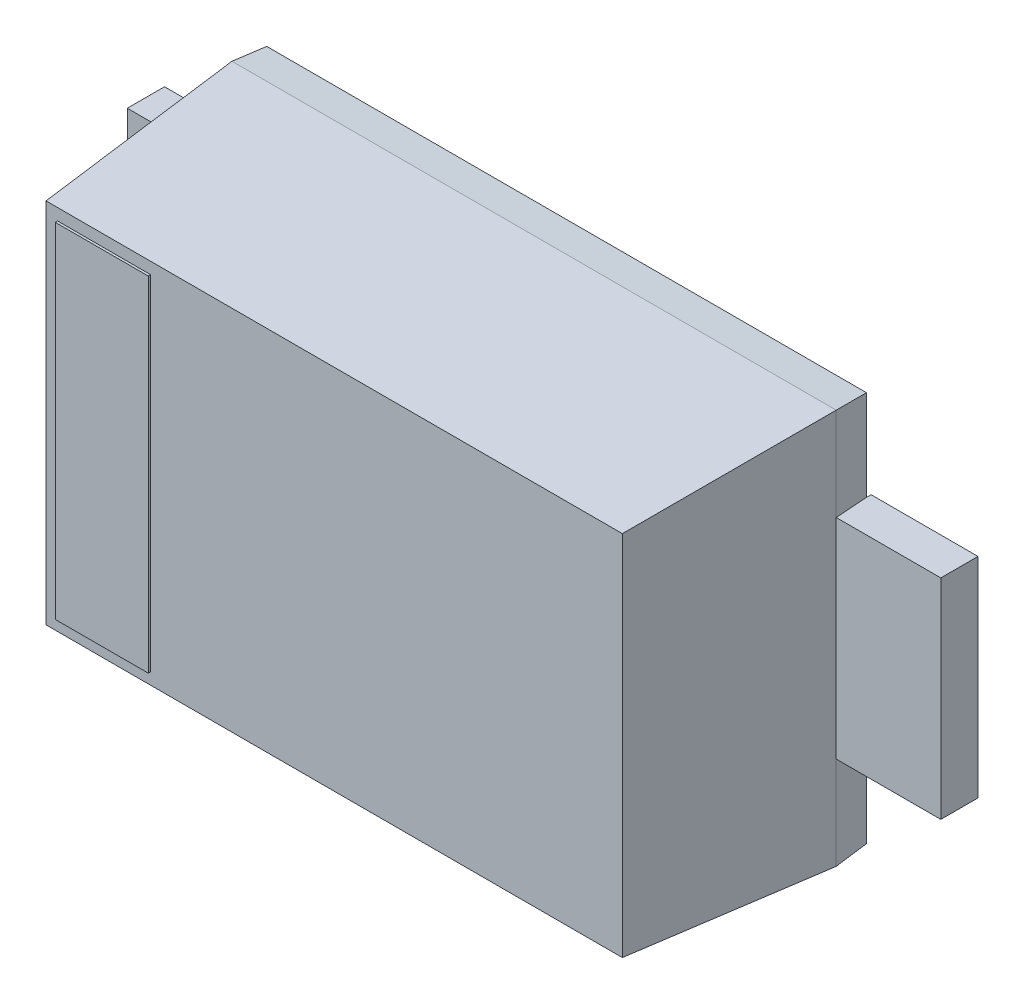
ISO-10303-21;
HEADER;
FILE_DESCRIPTION(('STEP AP214'),'2;1');
FILE_NAME('part.step','',(''),(''),'','','');
FILE_SCHEMA(('AUTOMOTIVE_DESIGN { 1 0 10303 214 1 1 1 1 }'));
ENDSEC;
DATA;
#1=APPLICATION_CONTEXT('core data for automotive mechanical design processes');
#2=APPLICATION_PROTOCOL_DEFINITION('international standard','automotive_design',2000,#1);
#3=PRODUCT_CONTEXT('',#1,'mechanical');
#4=PRODUCT('Part','Part','',(#3));
#5=PRODUCT_RELATED_PRODUCT_CATEGORY('part','',(#4));
#6=PRODUCT_DEFINITION_FORMATION('','',#4);
#7=PRODUCT_DEFINITION_CONTEXT('part definition',#1,'design');
#8=PRODUCT_DEFINITION('design','',#6,#7);
#9=PRODUCT_DEFINITION_SHAPE('','',#8);
#10=(LENGTH_UNIT() NAMED_UNIT(*) SI_UNIT(.MILLI.,.METRE.));
#11=(NAMED_UNIT(*) PLANE_ANGLE_UNIT() SI_UNIT($,.RADIAN.));
#12=(NAMED_UNIT(*) SI_UNIT($,.STERADIAN.) SOLID_ANGLE_UNIT());
#13=UNCERTAINTY_MEASURE_WITH_UNIT(LENGTH_MEASURE(1.E-05),#10,'distance_accuracy_value','');
#14=(GEOMETRIC_REPRESENTATION_CONTEXT(3) GLOBAL_UNCERTAINTY_ASSIGNED_CONTEXT((#13)) GLOBAL_UNIT_ASSIGNED_CONTEXT((#10,
#11,#12)) REPRESENTATION_CONTEXT('',''));
#15=CARTESIAN_POINT('',(0.,0.,0.));
#16=DIRECTION('',(0.,0.,1.));
#17=DIRECTION('',(1.,0.,0.));
#18=AXIS2_PLACEMENT_3D('',#15,#16,#17);
#19=CARTESIAN_POINT('',(-1.290210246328,0.45,0.16));
#20=DIRECTION('',(0.,0.,1.));
#21=DIRECTION('',(1.,0.,0.));
#22=AXIS2_PLACEMENT_3D('',#19,#20,#21);
#23=PLANE('',#22);
#24=DIRECTION('',(0.,-1.,0.));
#25=VECTOR('',#24,1.);
#26=CARTESIAN_POINT('',(-1.3,0.85,0.16));
#27=LINE('',#26,#25);
#28=CARTESIAN_POINT('',(-1.3,0.45,0.16));
#29=VERTEX_POINT('',#28);
#30=CARTESIAN_POINT('',(-1.3,-0.45,0.16));
#31=VERTEX_POINT('',#30);
#32=EDGE_CURVE('P0_E233',#29,#31,#27,.T.);
#33=ORIENTED_EDGE('',*,*,#32,.F.);
#34=DIRECTION('',(-1.,0.,0.));
#35=VECTOR('',#34,1.);
#36=CARTESIAN_POINT('',(-1.290210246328,0.45,0.16));
#37=LINE('',#36,#35);
#38=CARTESIAN_POINT('',(-1.290210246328,0.45,0.16));
#39=VERTEX_POINT('',#38);
#40=EDGE_CURVE('P0_E11',#39,#29,#37,.T.);
#41=ORIENTED_EDGE('',*,*,#40,.F.);
#42=DIRECTION('',(0.,-1.,0.));
#43=VECTOR('',#42,1.);
#44=CARTESIAN_POINT('',(-1.290210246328,0.45,0.16));
#45=LINE('',#44,#43);
#46=CARTESIAN_POINT('',(-1.290210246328,-0.45,0.16));
#47=VERTEX_POINT('',#46);
#48=EDGE_CURVE('P0_E219',#39,#47,#45,.T.);
#49=ORIENTED_EDGE('',*,*,#48,.T.);
#50=DIRECTION('',(-1.,0.,0.));
#51=VECTOR('',#50,1.);
#52=CARTESIAN_POINT('',(-1.290210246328,-0.45,0.16));
#53=LINE('',#52,#51);
#54=EDGE_CURVE('P0_E20',#47,#31,#53,.T.);
#55=ORIENTED_EDGE('',*,*,#54,.T.);
#56=EDGE_LOOP('',(#33,#41,#49,#55));
#57=FACE_BOUND('',#56,.T.);
#58=ADVANCED_FACE('P0_F17',(#57),#23,.F.);
#59=CARTESIAN_POINT('',(-1.290210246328,0.45,0.));
#60=DIRECTION('',(0.,-1.,0.));
#61=DIRECTION('',(-1.,0.,0.));
#62=AXIS2_PLACEMENT_3D('',#59,#60,#61);
#63=PLANE('',#62);
#64=CARTESIAN_POINT('',(-1.290210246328,0.45,0.02));
#65=CARTESIAN_POINT('',(-1.292201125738,0.45,0.04847090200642));
#66=CARTESIAN_POINT('',(-1.293503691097,0.45,0.06709845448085));
#67=CARTESIAN_POINT('',(-1.29513983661,0.45,0.09049642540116));
#68=CARTESIAN_POINT('',(-1.297400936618,0.45,0.122831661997));
#69=CARTESIAN_POINT('',(-1.299630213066,0.45,0.154711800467));
#70=CARTESIAN_POINT('',(-1.3,0.45,0.16));
#71=(BOUNDED_CURVE() B_SPLINE_CURVE(6,(#64,#65,#66,#67,#68,#69,#70),.UNSPECIFIED.,.F.,
.F.) B_SPLINE_CURVE_WITH_KNOTS((7,7),(0.,1.),
.UNSPECIFIED.) CURVE() GEOMETRIC_REPRESENTATION_ITEM() RATIONAL_B_SPLINE_CURVE((1.,1.,1.,1.,1.,
1.,1.)) REPRESENTATION_ITEM(''));
#72=CARTESIAN_POINT('',(-1.290210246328,0.45,0.02));
#73=VERTEX_POINT('',#72);
#74=EDGE_CURVE('P0_E195',#73,#29,#71,.T.);
#75=ORIENTED_EDGE('',*,*,#74,.F.);
#76=DIRECTION('',(0.,0.,1.));
#77=VECTOR('',#76,1.);
#78=CARTESIAN_POINT('',(-1.290210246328,0.45,0.));
#79=LINE('',#78,#77);
#80=EDGE_CURVE('P0_E211',#73,#39,#79,.T.);
#81=ORIENTED_EDGE('',*,*,#80,.T.);
#82=ORIENTED_EDGE('',*,*,#40,.T.);
#83=EDGE_LOOP('',(#75,#81,#82));
#84=FACE_BOUND('',#83,.T.);
#85=ADVANCED_FACE('P0_F403',(#84),#63,.T.);
#86=CARTESIAN_POINT('',(1.3,0.85,0.16));
#87=CARTESIAN_POINT('',(1.239862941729,0.789862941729,1.02));
#88=CARTESIAN_POINT('',(-1.3,0.85,0.16));
#89=CARTESIAN_POINT('',(-1.239862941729,0.789862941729,1.02));
#90=(BOUNDED_SURFACE() B_SPLINE_SURFACE(1,1,((#86,#87),(#88,#89)),.UNSPECIFIED.,.F.,.F.,
.F.) B_SPLINE_SURFACE_WITH_KNOTS((2,2),(2,2),(0.,2.6),(0.,1.),
.UNSPECIFIED.) GEOMETRIC_REPRESENTATION_ITEM() RATIONAL_B_SPLINE_SURFACE(((1.,1.),(1.,1.))) REPRESENTATION_ITEM('') SURFACE());
#91=DIRECTION('',(-1.,0.,0.));
#92=VECTOR('',#91,1.);
#93=CARTESIAN_POINT('',(1.3,0.85,0.16));
#94=LINE('',#93,#92);
#95=CARTESIAN_POINT('',(1.3,0.85,0.16));
#96=VERTEX_POINT('',#95);
#97=CARTESIAN_POINT('',(-1.3,0.85,0.16));
#98=VERTEX_POINT('',#97);
#99=EDGE_CURVE('P0_E194',#96,#98,#94,.T.);
#100=CARTESIAN_POINT('',(-1.3,0.85,0.16));
#101=CARTESIAN_POINT('',(-1.239862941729,0.789862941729,1.02));
#102=(BOUNDED_CURVE() B_SPLINE_CURVE(1,(#100,#101),.UNSPECIFIED.,.F.,
.F.) B_SPLINE_CURVE_WITH_KNOTS((2,2),(0.,1.),
.UNSPECIFIED.) CURVE() GEOMETRIC_REPRESENTATION_ITEM() RATIONAL_B_SPLINE_CURVE((1.,1.)) REPRESENTATION_ITEM(''));
#103=CARTESIAN_POINT('',(-1.239862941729,0.789862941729,1.02));
#104=VERTEX_POINT('',#103);
#105=EDGE_CURVE('P0_E39',#98,#104,#102,.T.);
#106=DIRECTION('',(-1.,0.,0.));
#107=VECTOR('',#106,1.);
#108=CARTESIAN_POINT('',(1.239862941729,0.789862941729,1.02));
#109=LINE('',#108,#107);
#110=CARTESIAN_POINT('',(1.239862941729,0.789862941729,1.02));
#111=VERTEX_POINT('',#110);
#112=EDGE_CURVE('P0_E46',#111,#104,#109,.T.);
#113=CARTESIAN_POINT('',(1.3,0.85,0.16));
#114=CARTESIAN_POINT('',(1.239862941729,0.789862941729,1.02));
#115=(BOUNDED_CURVE() B_SPLINE_CURVE(1,(#113,#114),.UNSPECIFIED.,.F.,
.F.) B_SPLINE_CURVE_WITH_KNOTS((2,2),(0.,1.),
.UNSPECIFIED.) CURVE() GEOMETRIC_REPRESENTATION_ITEM() RATIONAL_B_SPLINE_CURVE((1.,1.)) REPRESENTATION_ITEM(''));
#116=EDGE_CURVE('P0_E225',#96,#111,#115,.T.);
#117=ORIENTED_EDGE('',*,*,#99,.T.);
#118=ORIENTED_EDGE('',*,*,#105,.T.);
#119=ORIENTED_EDGE('',*,*,#112,.F.);
#120=ORIENTED_EDGE('',*,*,#116,.F.);
#121=EDGE_LOOP('',(#117,#118,#119,#120));
#122=FACE_BOUND('',#121,.T.);
#123=ADVANCED_FACE('P0_F394',(#122),#90,.T.);
#124=CARTESIAN_POINT('',(1.290210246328,0.45,0.));
#125=DIRECTION('',(0.,1.,0.));
#126=DIRECTION('',(1.,0.,0.));
#127=AXIS2_PLACEMENT_3D('',#124,#125,#126);
#128=PLANE('',#127);
#129=DIRECTION('',(1.,0.,0.));
#130=VECTOR('',#129,1.);
#131=CARTESIAN_POINT('',(1.290210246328,0.45,0.16));
#132=LINE('',#131,#130);
#133=CARTESIAN_POINT('',(1.290210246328,0.45,0.16));
#134=VERTEX_POINT('',#133);
#135=CARTESIAN_POINT('',(1.3,0.45,0.16));
#136=VERTEX_POINT('',#135);
#137=EDGE_CURVE('P0_E26',#134,#136,#132,.T.);
#138=ORIENTED_EDGE('',*,*,#137,.F.);
#139=DIRECTION('',(0.,0.,1.));
#140=VECTOR('',#139,1.);
#141=CARTESIAN_POINT('',(1.290210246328,0.45,0.));
#142=LINE('',#141,#140);
#143=CARTESIAN_POINT('',(1.290210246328,0.45,0.02));
#144=VERTEX_POINT('',#143);
#145=EDGE_CURVE('P0_E139',#144,#134,#142,.T.);
#146=ORIENTED_EDGE('',*,*,#145,.F.);
#147=CARTESIAN_POINT('',(1.290210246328,0.45,0.02));
#148=CARTESIAN_POINT('',(1.292201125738,0.45,0.04847090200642));
#149=CARTESIAN_POINT('',(1.293503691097,0.45,0.06709845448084));
#150=CARTESIAN_POINT('',(1.29513983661,0.45,0.09049642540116));
#151=CARTESIAN_POINT('',(1.297400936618,0.45,0.122831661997));
#152=CARTESIAN_POINT('',(1.299630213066,0.45,0.154711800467));
#153=CARTESIAN_POINT('',(1.3,0.45,0.16));
#154=(BOUNDED_CURVE() B_SPLINE_CURVE(6,(#147,#148,#149,#150,#151,#152,#153),.UNSPECIFIED.,.F.,
.F.) B_SPLINE_CURVE_WITH_KNOTS((7,7),(0.,1.),
.UNSPECIFIED.) CURVE() GEOMETRIC_REPRESENTATION_ITEM() RATIONAL_B_SPLINE_CURVE((1.,1.,1.,1.,1.,
1.,1.)) REPRESENTATION_ITEM(''));
#155=EDGE_CURVE('P0_E141',#144,#136,#154,.T.);
#156=ORIENTED_EDGE('',*,*,#155,.T.);
#157=EDGE_LOOP('',(#138,#146,#156));
#158=FACE_BOUND('',#157,.T.);
#159=ADVANCED_FACE('P0_F137',(#158),#128,.F.);
#160=CARTESIAN_POINT('',(1.290210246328,-0.45,0.16));
#161=DIRECTION('',(0.,0.,1.));
#162=DIRECTION('',(1.,0.,0.));
#163=AXIS2_PLACEMENT_3D('',#160,#161,#162);
#164=PLANE('',#163);
#165=DIRECTION('',(0.,1.,0.));
#166=VECTOR('',#165,1.);
#167=CARTESIAN_POINT('',(1.3,-0.85,0.16));
#168=LINE('',#167,#166);
#169=CARTESIAN_POINT('',(1.3,-0.45,0.16));
#170=VERTEX_POINT('',#169);
#171=EDGE_CURVE('P0_E223',#170,#136,#168,.T.);
#172=ORIENTED_EDGE('',*,*,#171,.F.);
#173=DIRECTION('',(1.,0.,0.));
#174=VECTOR('',#173,1.);
#175=CARTESIAN_POINT('',(1.290210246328,-0.45,0.16));
#176=LINE('',#175,#174);
#177=CARTESIAN_POINT('',(1.290210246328,-0.45,0.16));
#178=VERTEX_POINT('',#177);
#179=EDGE_CURVE('P0_E150',#178,#170,#176,.T.);
#180=ORIENTED_EDGE('',*,*,#179,.F.);
#181=DIRECTION('',(0.,1.,0.));
#182=VECTOR('',#181,1.);
#183=CARTESIAN_POINT('',(1.290210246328,-0.45,0.16));
#184=LINE('',#183,#182);
#185=EDGE_CURVE('P0_E148',#178,#134,#184,.T.);
#186=ORIENTED_EDGE('',*,*,#185,.T.);
#187=ORIENTED_EDGE('',*,*,#137,.T.);
#188=EDGE_LOOP('',(#172,#180,#186,#187));
#189=FACE_BOUND('',#188,.T.);
#190=ADVANCED_FACE('P0_F149',(#189),#164,.F.);
#191=CARTESIAN_POINT('',(-1.290210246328,-0.45,0.));
#192=DIRECTION('',(0.,-1.,0.));
#193=DIRECTION('',(-1.,0.,0.));
#194=AXIS2_PLACEMENT_3D('',#191,#192,#193);
#195=PLANE('',#194);
#196=ORIENTED_EDGE('',*,*,#54,.F.);
#197=DIRECTION('',(0.,0.,1.));
#198=VECTOR('',#197,1.);
#199=CARTESIAN_POINT('',(-1.290210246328,-0.45,0.));
#200=LINE('',#199,#198);
#201=CARTESIAN_POINT('',(-1.290210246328,-0.45,0.02));
#202=VERTEX_POINT('',#201);
#203=EDGE_CURVE('P0_E215',#202,#47,#200,.T.);
#204=ORIENTED_EDGE('',*,*,#203,.F.);
#205=CARTESIAN_POINT('',(-1.290210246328,-0.45,0.02));
#206=CARTESIAN_POINT('',(-1.292201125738,-0.45,0.04847090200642));
#207=CARTESIAN_POINT('',(-1.293503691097,-0.45,0.06709845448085));
#208=CARTESIAN_POINT('',(-1.29513983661,-0.45,0.09049642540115));
#209=CARTESIAN_POINT('',(-1.297400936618,-0.45,0.122831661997));
#210=CARTESIAN_POINT('',(-1.299630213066,-0.45,0.154711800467));
#211=CARTESIAN_POINT('',(-1.3,-0.45,0.16));
#212=(BOUNDED_CURVE() B_SPLINE_CURVE(6,(#205,#206,#207,#208,#209,#210,#211),.UNSPECIFIED.,.F.,
.F.) B_SPLINE_CURVE_WITH_KNOTS((7,7),(0.,1.),
.UNSPECIFIED.) CURVE() GEOMETRIC_REPRESENTATION_ITEM() RATIONAL_B_SPLINE_CURVE((1.,1.,1.,1.,1.,
1.,1.)) REPRESENTATION_ITEM(''));
#213=EDGE_CURVE('P0_E262',#202,#31,#212,.T.);
#214=ORIENTED_EDGE('',*,*,#213,.T.);
#215=EDGE_LOOP('',(#196,#204,#214));
#216=FACE_BOUND('',#215,.T.);
#217=ADVANCED_FACE('P0_F269',(#216),#195,.F.);
#218=CARTESIAN_POINT('',(-1.3,0.85,0.16));
#219=CARTESIAN_POINT('',(-1.239862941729,0.789862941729,1.02));
#220=CARTESIAN_POINT('',(-1.3,-0.85,0.16));
#221=CARTESIAN_POINT('',(-1.239862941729,-0.789862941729,1.02));
#222=(BOUNDED_SURFACE() B_SPLINE_SURFACE(1,1,((#218,#219),(#220,#221)),.UNSPECIFIED.,.F.,.F.,
.F.) B_SPLINE_SURFACE_WITH_KNOTS((2,2),(2,2),(0.,1.7),(0.,1.),
.UNSPECIFIED.) GEOMETRIC_REPRESENTATION_ITEM() RATIONAL_B_SPLINE_SURFACE(((1.,1.),(1.,1.))) REPRESENTATION_ITEM('') SURFACE());
#223=DIRECTION('',(0.,-1.,0.));
#224=VECTOR('',#223,1.);
#225=CARTESIAN_POINT('',(-1.3,0.85,0.16));
#226=LINE('',#225,#224);
#227=EDGE_CURVE('P0_E204',#98,#29,#226,.T.);
#228=DIRECTION('',(0.,-1.,0.));
#229=VECTOR('',#228,1.);
#230=CARTESIAN_POINT('',(-1.3,0.85,0.16));
#231=LINE('',#230,#229);
#232=CARTESIAN_POINT('',(-1.3,-0.85,0.16));
#233=VERTEX_POINT('',#232);
#234=EDGE_CURVE('P0_E165',#31,#233,#231,.T.);
#235=CARTESIAN_POINT('',(-1.3,-0.85,0.16));
#236=CARTESIAN_POINT('',(-1.239862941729,-0.789862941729,1.02));
#237=(BOUNDED_CURVE() B_SPLINE_CURVE(1,(#235,#236),.UNSPECIFIED.,.F.,
.F.) B_SPLINE_CURVE_WITH_KNOTS((2,2),(0.,1.),
.UNSPECIFIED.) CURVE() GEOMETRIC_REPRESENTATION_ITEM() RATIONAL_B_SPLINE_CURVE((1.,1.)) REPRESENTATION_ITEM(''));
#238=CARTESIAN_POINT('',(-1.239862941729,-0.789862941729,1.02));
#239=VERTEX_POINT('',#238);
#240=EDGE_CURVE('P0_E271',#233,#239,#237,.T.);
#241=DIRECTION('',(0.,-1.,0.));
#242=VECTOR('',#241,1.);
#243=CARTESIAN_POINT('',(-1.239862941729,0.789862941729,1.02));
#244=LINE('',#243,#242);
#245=EDGE_CURVE('P0_E231',#104,#239,#244,.T.);
#246=ORIENTED_EDGE('',*,*,#227,.T.);
#247=ORIENTED_EDGE('',*,*,#32,.T.);
#248=ORIENTED_EDGE('',*,*,#234,.T.);
#249=ORIENTED_EDGE('',*,*,#240,.T.);
#250=ORIENTED_EDGE('',*,*,#245,.F.);
#251=ORIENTED_EDGE('',*,*,#105,.F.);
#252=EDGE_LOOP('',(#246,#247,#248,#249,#250,#251));
#253=FACE_BOUND('',#252,.T.);
#254=ADVANCED_FACE('P0_F254',(#253),#222,.T.);
#255=CARTESIAN_POINT('',(-1.239862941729,-0.789862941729,1.02));
#256=DIRECTION('',(0.,0.,-1.));
#257=DIRECTION('',(0.,-1.,0.));
#258=AXIS2_PLACEMENT_3D('',#255,#256,#257);
#259=PLANE('',#258);
#260=DIRECTION('',(1.,0.,0.));
#261=VECTOR('',#260,1.);
#262=CARTESIAN_POINT('',(-1.239862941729,-0.789862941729,1.02));
#263=LINE('',#262,#261);
#264=CARTESIAN_POINT('',(1.239862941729,-0.789862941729,1.02));
#265=VERTEX_POINT('',#264);
#266=EDGE_CURVE('P0_E275',#239,#265,#263,.T.);
#267=ORIENTED_EDGE('',*,*,#266,.T.);
#268=DIRECTION('',(0.,1.,0.));
#269=VECTOR('',#268,1.);
#270=CARTESIAN_POINT('',(1.239862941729,-0.789862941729,1.02));
#271=LINE('',#270,#269);
#272=EDGE_CURVE('P0_E178',#265,#111,#271,.T.);
#273=ORIENTED_EDGE('',*,*,#272,.T.);
#274=ORIENTED_EDGE('',*,*,#112,.T.);
#275=ORIENTED_EDGE('',*,*,#245,.T.);
#276=EDGE_LOOP('',(#267,#273,#274,#275));
#277=FACE_BOUND('',#276,.T.);
#278=ADVANCED_FACE('P0_F390',(#277),#259,.F.);
#279=CARTESIAN_POINT('',(1.290210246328,-0.45,0.));
#280=DIRECTION('',(0.,1.,0.));
#281=DIRECTION('',(1.,0.,0.));
#282=AXIS2_PLACEMENT_3D('',#279,#280,#281);
#283=PLANE('',#282);
#284=CARTESIAN_POINT('',(1.290210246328,-0.45,0.02));
#285=CARTESIAN_POINT('',(1.292201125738,-0.45,0.04847090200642));
#286=CARTESIAN_POINT('',(1.293503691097,-0.45,0.06709845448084));
#287=CARTESIAN_POINT('',(1.29513983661,-0.45,0.09049642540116));
#288=CARTESIAN_POINT('',(1.297400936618,-0.45,0.122831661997));
#289=CARTESIAN_POINT('',(1.299630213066,-0.45,0.154711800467));
#290=CARTESIAN_POINT('',(1.3,-0.45,0.16));
#291=(BOUNDED_CURVE() B_SPLINE_CURVE(6,(#284,#285,#286,#287,#288,#289,#290),.UNSPECIFIED.,.F.,
.F.) B_SPLINE_CURVE_WITH_KNOTS((7,7),(0.,1.),
.UNSPECIFIED.) CURVE() GEOMETRIC_REPRESENTATION_ITEM() RATIONAL_B_SPLINE_CURVE((1.,1.,1.,1.,1.,
1.,1.)) REPRESENTATION_ITEM(''));
#292=CARTESIAN_POINT('',(1.290210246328,-0.45,0.02));
#293=VERTEX_POINT('',#292);
#294=EDGE_CURVE('P0_E287',#293,#170,#291,.T.);
#295=ORIENTED_EDGE('',*,*,#294,.F.);
#296=DIRECTION('',(0.,0.,1.));
#297=VECTOR('',#296,1.);
#298=CARTESIAN_POINT('',(1.290210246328,-0.45,0.));
#299=LINE('',#298,#297);
#300=EDGE_CURVE('P0_E160',#293,#178,#299,.T.);
#301=ORIENTED_EDGE('',*,*,#300,.T.);
#302=ORIENTED_EDGE('',*,*,#179,.T.);
#303=EDGE_LOOP('',(#295,#301,#302));
#304=FACE_BOUND('',#303,.T.);
#305=ADVANCED_FACE('P0_F454',(#304),#283,.T.);
#306=CARTESIAN_POINT('',(1.3,-0.85,0.16));
#307=CARTESIAN_POINT('',(1.239862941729,-0.789862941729,1.02));
#308=CARTESIAN_POINT('',(1.3,0.85,0.16));
#309=CARTESIAN_POINT('',(1.239862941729,0.789862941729,1.02));
#310=(BOUNDED_SURFACE() B_SPLINE_SURFACE(1,1,((#306,#307),(#308,#309)),.UNSPECIFIED.,.F.,.F.,
.F.) B_SPLINE_SURFACE_WITH_KNOTS((2,2),(2,2),(0.,1.7),(0.,1.),
.UNSPECIFIED.) GEOMETRIC_REPRESENTATION_ITEM() RATIONAL_B_SPLINE_SURFACE(((1.,1.),(1.,1.))) REPRESENTATION_ITEM('') SURFACE());
#311=DIRECTION('',(0.,1.,0.));
#312=VECTOR('',#311,1.);
#313=CARTESIAN_POINT('',(1.3,-0.85,0.16));
#314=LINE('',#313,#312);
#315=CARTESIAN_POINT('',(1.3,-0.85,0.16));
#316=VERTEX_POINT('',#315);
#317=EDGE_CURVE('P0_E280',#316,#170,#314,.T.);
#318=DIRECTION('',(0.,1.,0.));
#319=VECTOR('',#318,1.);
#320=CARTESIAN_POINT('',(1.3,-0.85,0.16));
#321=LINE('',#320,#319);
#322=EDGE_CURVE('P0_E184',#136,#96,#321,.T.);
#323=CARTESIAN_POINT('',(1.3,-0.85,0.16));
#324=CARTESIAN_POINT('',(1.239862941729,-0.789862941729,1.02));
#325=(BOUNDED_CURVE() B_SPLINE_CURVE(1,(#323,#324),.UNSPECIFIED.,.F.,
.F.) B_SPLINE_CURVE_WITH_KNOTS((2,2),(0.,1.),
.UNSPECIFIED.) CURVE() GEOMETRIC_REPRESENTATION_ITEM() RATIONAL_B_SPLINE_CURVE((1.,1.)) REPRESENTATION_ITEM(''));
#326=EDGE_CURVE('P0_E286',#316,#265,#325,.T.);
#327=ORIENTED_EDGE('',*,*,#317,.T.);
#328=ORIENTED_EDGE('',*,*,#171,.T.);
#329=ORIENTED_EDGE('',*,*,#322,.T.);
#330=ORIENTED_EDGE('',*,*,#116,.T.);
#331=ORIENTED_EDGE('',*,*,#272,.F.);
#332=ORIENTED_EDGE('',*,*,#326,.F.);
#333=EDGE_LOOP('',(#327,#328,#329,#330,#331,#332));
#334=FACE_BOUND('',#333,.T.);
#335=ADVANCED_FACE('P0_F391',(#334),#310,.T.);
#336=CARTESIAN_POINT('',(-1.290210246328,0.45,0.));
#337=DIRECTION('',(-1.,0.,0.));
#338=DIRECTION('',(0.,0.,1.));
#339=AXIS2_PLACEMENT_3D('',#336,#337,#338);
#340=PLANE('',#339);
#341=ORIENTED_EDGE('',*,*,#80,.F.);
#342=DIRECTION('',(0.,-1.,0.));
#343=VECTOR('',#342,1.);
#344=CARTESIAN_POINT('',(-1.290210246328,0.840210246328,0.02));
#345=LINE('',#344,#343);
#346=EDGE_CURVE('P0_E319',#73,#202,#345,.T.);
#347=ORIENTED_EDGE('',*,*,#346,.T.);
#348=ORIENTED_EDGE('',*,*,#203,.T.);
#349=ORIENTED_EDGE('',*,*,#48,.F.);
#350=EDGE_LOOP('',(#341,#347,#348,#349));
#351=FACE_BOUND('',#350,.T.);
#352=ADVANCED_FACE('P0_F405',(#351),#340,.T.);
#353=CARTESIAN_POINT('',(-1.290210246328,0.840210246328,0.02));
#354=CARTESIAN_POINT('',(-1.3,0.85,0.16));
#355=CARTESIAN_POINT('',(-1.290210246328,-0.840210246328,0.02));
#356=CARTESIAN_POINT('',(-1.3,-0.85,0.16));
#357=(BOUNDED_SURFACE() B_SPLINE_SURFACE(1,1,((#353,#354),(#355,#356)),.UNSPECIFIED.,.F.,.F.,
.F.) B_SPLINE_SURFACE_WITH_KNOTS((2,2),(2,2),(0.,1.7),(0.,1.),
.UNSPECIFIED.) GEOMETRIC_REPRESENTATION_ITEM() RATIONAL_B_SPLINE_SURFACE(((1.,1.),(1.,1.))) REPRESENTATION_ITEM('') SURFACE());
#358=CARTESIAN_POINT('',(-1.290210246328,0.840210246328,0.02));
#359=CARTESIAN_POINT('',(-1.3,0.85,0.16));
#360=(BOUNDED_CURVE() B_SPLINE_CURVE(1,(#358,#359),.UNSPECIFIED.,.F.,
.F.) B_SPLINE_CURVE_WITH_KNOTS((2,2),(0.,1.),
.UNSPECIFIED.) CURVE() GEOMETRIC_REPRESENTATION_ITEM() RATIONAL_B_SPLINE_CURVE((1.,1.)) REPRESENTATION_ITEM(''));
#361=CARTESIAN_POINT('',(-1.290210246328,0.840210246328,0.02));
#362=VERTEX_POINT('',#361);
#363=EDGE_CURVE('P0_E185',#362,#98,#360,.T.);
#364=DIRECTION('',(0.,-1.,0.));
#365=VECTOR('',#364,1.);
#366=CARTESIAN_POINT('',(-1.290210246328,0.840210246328,0.02));
#367=LINE('',#366,#365);
#368=EDGE_CURVE('P0_E316',#362,#73,#367,.T.);
#369=ORIENTED_EDGE('',*,*,#363,.F.);
#370=ORIENTED_EDGE('',*,*,#368,.T.);
#371=ORIENTED_EDGE('',*,*,#74,.T.);
#372=ORIENTED_EDGE('',*,*,#227,.F.);
#373=EDGE_LOOP('',(#369,#370,#371,#372));
#374=FACE_BOUND('',#373,.T.);
#375=ADVANCED_FACE('P0_F400',(#374),#357,.T.);
#376=CARTESIAN_POINT('',(1.290210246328,0.840210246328,0.02));
#377=CARTESIAN_POINT('',(1.3,0.85,0.16));
#378=CARTESIAN_POINT('',(-1.290210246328,0.840210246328,0.02));
#379=CARTESIAN_POINT('',(-1.3,0.85,0.16));
#380=(BOUNDED_SURFACE() B_SPLINE_SURFACE(1,1,((#376,#377),(#378,#379)),.UNSPECIFIED.,.F.,.F.,
.F.) B_SPLINE_SURFACE_WITH_KNOTS((2,2),(2,2),(0.,2.6),(0.,1.),
.UNSPECIFIED.) GEOMETRIC_REPRESENTATION_ITEM() RATIONAL_B_SPLINE_SURFACE(((1.,1.),(1.,1.))) REPRESENTATION_ITEM('') SURFACE());
#381=DIRECTION('',(-1.,0.,0.));
#382=VECTOR('',#381,1.);
#383=CARTESIAN_POINT('',(1.290210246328,0.840210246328,0.02));
#384=LINE('',#383,#382);
#385=CARTESIAN_POINT('',(1.290210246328,0.840210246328,0.02));
#386=VERTEX_POINT('',#385);
#387=EDGE_CURVE('P0_E312',#386,#362,#384,.T.);
#388=CARTESIAN_POINT('',(1.290210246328,0.840210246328,0.02));
#389=CARTESIAN_POINT('',(1.3,0.85,0.16));
#390=(BOUNDED_CURVE() B_SPLINE_CURVE(1,(#388,#389),.UNSPECIFIED.,.F.,
.F.) B_SPLINE_CURVE_WITH_KNOTS((2,2),(0.,1.),
.UNSPECIFIED.) CURVE() GEOMETRIC_REPRESENTATION_ITEM() RATIONAL_B_SPLINE_CURVE((1.,1.)) REPRESENTATION_ITEM(''));
#391=EDGE_CURVE('P0_E172',#386,#96,#390,.T.);
#392=ORIENTED_EDGE('',*,*,#387,.T.);
#393=ORIENTED_EDGE('',*,*,#363,.T.);
#394=ORIENTED_EDGE('',*,*,#99,.F.);
#395=ORIENTED_EDGE('',*,*,#391,.F.);
#396=EDGE_LOOP('',(#392,#393,#394,#395));
#397=FACE_BOUND('',#396,.T.);
#398=ADVANCED_FACE('P0_F396',(#397),#380,.T.);
#399=CARTESIAN_POINT('',(1.290210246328,-0.840210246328,0.02));
#400=CARTESIAN_POINT('',(1.3,-0.85,0.16));
#401=CARTESIAN_POINT('',(1.290210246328,0.840210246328,0.02));
#402=CARTESIAN_POINT('',(1.3,0.85,0.16));
#403=(BOUNDED_SURFACE() B_SPLINE_SURFACE(1,1,((#399,#400),(#401,#402)),.UNSPECIFIED.,.F.,.F.,
.F.) B_SPLINE_SURFACE_WITH_KNOTS((2,2),(2,2),(0.,1.7),(0.,1.),
.UNSPECIFIED.) GEOMETRIC_REPRESENTATION_ITEM() RATIONAL_B_SPLINE_SURFACE(((1.,1.),(1.,1.))) REPRESENTATION_ITEM('') SURFACE());
#404=DIRECTION('',(0.,1.,0.));
#405=VECTOR('',#404,1.);
#406=CARTESIAN_POINT('',(1.290210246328,-0.840210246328,0.02));
#407=LINE('',#406,#405);
#408=EDGE_CURVE('P0_E308',#144,#386,#407,.T.);
#409=ORIENTED_EDGE('',*,*,#155,.F.);
#410=ORIENTED_EDGE('',*,*,#408,.T.);
#411=ORIENTED_EDGE('',*,*,#391,.T.);
#412=ORIENTED_EDGE('',*,*,#322,.F.);
#413=EDGE_LOOP('',(#409,#410,#411,#412));
#414=FACE_BOUND('',#413,.T.);
#415=ADVANCED_FACE('P0_F407',(#414),#403,.T.);
#416=CARTESIAN_POINT('',(1.290210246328,-0.45,0.));
#417=DIRECTION('',(1.,0.,0.));
#418=DIRECTION('',(0.,-1.,0.));
#419=AXIS2_PLACEMENT_3D('',#416,#417,#418);
#420=PLANE('',#419);
#421=ORIENTED_EDGE('',*,*,#300,.F.);
#422=DIRECTION('',(0.,1.,0.));
#423=VECTOR('',#422,1.);
#424=CARTESIAN_POINT('',(1.290210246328,-0.840210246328,0.02));
#425=LINE('',#424,#423);
#426=EDGE_CURVE('P0_E157',#293,#144,#425,.T.);
#427=ORIENTED_EDGE('',*,*,#426,.T.);
#428=ORIENTED_EDGE('',*,*,#145,.T.);
#429=ORIENTED_EDGE('',*,*,#185,.F.);
#430=EDGE_LOOP('',(#421,#427,#428,#429));
#431=FACE_BOUND('',#430,.T.);
#432=ADVANCED_FACE('P0_F155',(#431),#420,.T.);
#433=CARTESIAN_POINT('',(-1.290210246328,0.840210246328,0.02));
#434=CARTESIAN_POINT('',(-1.3,0.85,0.16));
#435=CARTESIAN_POINT('',(-1.290210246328,-0.840210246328,0.02));
#436=CARTESIAN_POINT('',(-1.3,-0.85,0.16));
#437=(BOUNDED_SURFACE() B_SPLINE_SURFACE(1,1,((#433,#434),(#435,#436)),.UNSPECIFIED.,.F.,.F.,
.F.) B_SPLINE_SURFACE_WITH_KNOTS((2,2),(2,2),(0.,1.7),(0.,1.),
.UNSPECIFIED.) GEOMETRIC_REPRESENTATION_ITEM() RATIONAL_B_SPLINE_SURFACE(((1.,1.),(1.,1.))) REPRESENTATION_ITEM('') SURFACE());
#438=DIRECTION('',(0.,-1.,0.));
#439=VECTOR('',#438,1.);
#440=CARTESIAN_POINT('',(-1.290210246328,0.840210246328,0.02));
#441=LINE('',#440,#439);
#442=CARTESIAN_POINT('',(-1.290210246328,-0.840210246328,0.02));
#443=VERTEX_POINT('',#442);
#444=EDGE_CURVE('P0_E326',#202,#443,#441,.T.);
#445=CARTESIAN_POINT('',(-1.290210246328,-0.840210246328,0.02));
#446=CARTESIAN_POINT('',(-1.3,-0.85,0.16));
#447=(BOUNDED_CURVE() B_SPLINE_CURVE(1,(#445,#446),.UNSPECIFIED.,.F.,
.F.) B_SPLINE_CURVE_WITH_KNOTS((2,2),(0.,1.),
.UNSPECIFIED.) CURVE() GEOMETRIC_REPRESENTATION_ITEM() RATIONAL_B_SPLINE_CURVE((1.,1.)) REPRESENTATION_ITEM(''));
#448=EDGE_CURVE('P0_E265',#443,#233,#447,.T.);
#449=ORIENTED_EDGE('',*,*,#213,.F.);
#450=ORIENTED_EDGE('',*,*,#444,.T.);
#451=ORIENTED_EDGE('',*,*,#448,.T.);
#452=ORIENTED_EDGE('',*,*,#234,.F.);
#453=EDGE_LOOP('',(#449,#450,#451,#452));
#454=FACE_BOUND('',#453,.T.);
#455=ADVANCED_FACE('P0_F261',(#454),#437,.T.);
#456=CARTESIAN_POINT('',(-1.3,-0.85,0.16));
#457=CARTESIAN_POINT('',(-1.239862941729,-0.789862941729,1.02));
#458=CARTESIAN_POINT('',(1.3,-0.85,0.16));
#459=CARTESIAN_POINT('',(1.239862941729,-0.789862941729,1.02));
#460=(BOUNDED_SURFACE() B_SPLINE_SURFACE(1,1,((#456,#457),(#458,#459)),.UNSPECIFIED.,.F.,.F.,
.F.) B_SPLINE_SURFACE_WITH_KNOTS((2,2),(2,2),(0.,2.6),(0.,1.),
.UNSPECIFIED.) GEOMETRIC_REPRESENTATION_ITEM() RATIONAL_B_SPLINE_SURFACE(((1.,1.),(1.,1.))) REPRESENTATION_ITEM('') SURFACE());
#461=DIRECTION('',(1.,0.,0.));
#462=VECTOR('',#461,1.);
#463=CARTESIAN_POINT('',(-1.3,-0.85,0.16));
#464=LINE('',#463,#462);
#465=EDGE_CURVE('P0_E343',#233,#316,#464,.T.);
#466=ORIENTED_EDGE('',*,*,#465,.T.);
#467=ORIENTED_EDGE('',*,*,#326,.T.);
#468=ORIENTED_EDGE('',*,*,#266,.F.);
#469=ORIENTED_EDGE('',*,*,#240,.F.);
#470=EDGE_LOOP('',(#466,#467,#468,#469));
#471=FACE_BOUND('',#470,.T.);
#472=ADVANCED_FACE('P0_F387',(#471),#460,.T.);
#473=CARTESIAN_POINT('',(1.290210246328,-0.840210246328,0.02));
#474=CARTESIAN_POINT('',(1.3,-0.85,0.16));
#475=CARTESIAN_POINT('',(1.290210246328,0.840210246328,0.02));
#476=CARTESIAN_POINT('',(1.3,0.85,0.16));
#477=(BOUNDED_SURFACE() B_SPLINE_SURFACE(1,1,((#473,#474),(#475,#476)),.UNSPECIFIED.,.F.,.F.,
.F.) B_SPLINE_SURFACE_WITH_KNOTS((2,2),(2,2),(0.,1.7),(0.,1.),
.UNSPECIFIED.) GEOMETRIC_REPRESENTATION_ITEM() RATIONAL_B_SPLINE_SURFACE(((1.,1.),(1.,1.))) REPRESENTATION_ITEM('') SURFACE());
#478=CARTESIAN_POINT('',(1.290210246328,-0.840210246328,0.02));
#479=CARTESIAN_POINT('',(1.3,-0.85,0.16));
#480=(BOUNDED_CURVE() B_SPLINE_CURVE(1,(#478,#479),.UNSPECIFIED.,.F.,
.F.) B_SPLINE_CURVE_WITH_KNOTS((2,2),(0.,1.),
.UNSPECIFIED.) CURVE() GEOMETRIC_REPRESENTATION_ITEM() RATIONAL_B_SPLINE_CURVE((1.,1.)) REPRESENTATION_ITEM(''));
#481=CARTESIAN_POINT('',(1.290210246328,-0.840210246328,0.02));
#482=VERTEX_POINT('',#481);
#483=EDGE_CURVE('P0_E359',#482,#316,#480,.T.);
#484=DIRECTION('',(0.,1.,0.));
#485=VECTOR('',#484,1.);
#486=CARTESIAN_POINT('',(1.290210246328,-0.840210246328,0.02));
#487=LINE('',#486,#485);
#488=EDGE_CURVE('P0_E293',#482,#293,#487,.T.);
#489=ORIENTED_EDGE('',*,*,#483,.F.);
#490=ORIENTED_EDGE('',*,*,#488,.T.);
#491=ORIENTED_EDGE('',*,*,#294,.T.);
#492=ORIENTED_EDGE('',*,*,#317,.F.);
#493=EDGE_LOOP('',(#489,#490,#491,#492));
#494=FACE_BOUND('',#493,.T.);
#495=ADVANCED_FACE('P0_F383',(#494),#477,.T.);
#496=CARTESIAN_POINT('',(-1.290210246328,-0.840210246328,0.02));
#497=DIRECTION('',(0.,0.,-1.));
#498=DIRECTION('',(0.,-1.,0.));
#499=AXIS2_PLACEMENT_3D('',#496,#497,#498);
#500=PLANE('',#499);
#501=ORIENTED_EDGE('',*,*,#444,.F.);
#502=ORIENTED_EDGE('',*,*,#346,.F.);
#503=ORIENTED_EDGE('',*,*,#368,.F.);
#504=ORIENTED_EDGE('',*,*,#387,.F.);
#505=ORIENTED_EDGE('',*,*,#408,.F.);
#506=ORIENTED_EDGE('',*,*,#426,.F.);
#507=ORIENTED_EDGE('',*,*,#488,.F.);
#508=DIRECTION('',(1.,0.,0.));
#509=VECTOR('',#508,1.);
#510=CARTESIAN_POINT('',(-1.290210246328,-0.840210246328,0.02));
#511=LINE('',#510,#509);
#512=EDGE_CURVE('P0_E366',#443,#482,#511,.T.);
#513=ORIENTED_EDGE('',*,*,#512,.F.);
#514=EDGE_LOOP('',(#501,#502,#503,#504,#505,#506,#507,#513));
#515=FACE_BOUND('',#514,.T.);
#516=ADVANCED_FACE('P0_F379',(#515),#500,.T.);
#517=CARTESIAN_POINT('',(-1.290210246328,-0.840210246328,0.02));
#518=CARTESIAN_POINT('',(-1.3,-0.85,0.16));
#519=CARTESIAN_POINT('',(1.290210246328,-0.840210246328,0.02));
#520=CARTESIAN_POINT('',(1.3,-0.85,0.16));
#521=(BOUNDED_SURFACE() B_SPLINE_SURFACE(1,1,((#517,#518),(#519,#520)),.UNSPECIFIED.,.F.,.F.,
.F.) B_SPLINE_SURFACE_WITH_KNOTS((2,2),(2,2),(0.,2.6),(0.,1.),
.UNSPECIFIED.) GEOMETRIC_REPRESENTATION_ITEM() RATIONAL_B_SPLINE_SURFACE(((1.,1.),(1.,1.))) REPRESENTATION_ITEM('') SURFACE());
#522=ORIENTED_EDGE('',*,*,#512,.T.);
#523=ORIENTED_EDGE('',*,*,#483,.T.);
#524=ORIENTED_EDGE('',*,*,#465,.F.);
#525=ORIENTED_EDGE('',*,*,#448,.F.);
#526=EDGE_LOOP('',(#522,#523,#524,#525));
#527=FACE_BOUND('',#526,.T.);
#528=ADVANCED_FACE('P0_F375',(#527),#521,.T.);
#529=CLOSED_SHELL('',(#58,#85,#123,#159,#190,#217,#254,#278,#305,#335,#352,#375,#398,#415,#432,
#455,#472,#495,#516,#528));
#530=MANIFOLD_SOLID_BREP('P0_B1',#529);
#531=CARTESIAN_POINT('',(1.290210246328,-0.45,0.16));
#532=DIRECTION('',(0.,0.,1.));
#533=DIRECTION('',(1.,0.,0.));
#534=AXIS2_PLACEMENT_3D('',#531,#532,#533);
#535=PLANE('',#534);
#536=DIRECTION('',(0.,1.,0.));
#537=VECTOR('',#536,1.);
#538=CARTESIAN_POINT('',(1.290210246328,-0.45,0.16));
#539=LINE('',#538,#537);
#540=CARTESIAN_POINT('',(1.290210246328,-0.45,0.16));
#541=VERTEX_POINT('',#540);
#542=CARTESIAN_POINT('',(1.290210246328,0.45,0.16));
#543=VERTEX_POINT('',#542);
#544=EDGE_CURVE('P1_E75',#541,#543,#539,.T.);
#545=ORIENTED_EDGE('',*,*,#544,.F.);
#546=DIRECTION('',(1.,0.,0.));
#547=VECTOR('',#546,1.);
#548=CARTESIAN_POINT('',(1.290210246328,-0.45,0.16));
#549=LINE('',#548,#547);
#550=CARTESIAN_POINT('',(1.75,-0.45,0.16));
#551=VERTEX_POINT('',#550);
#552=EDGE_CURVE('P1_E70',#541,#551,#549,.T.);
#553=ORIENTED_EDGE('',*,*,#552,.T.);
#554=DIRECTION('',(0.,1.,0.));
#555=VECTOR('',#554,1.);
#556=CARTESIAN_POINT('',(1.75,-0.45,0.16));
#557=LINE('',#556,#555);
#558=CARTESIAN_POINT('',(1.75,0.45,0.16));
#559=VERTEX_POINT('',#558);
#560=EDGE_CURVE('P1_E72',#551,#559,#557,.T.);
#561=ORIENTED_EDGE('',*,*,#560,.T.);
#562=DIRECTION('',(1.,0.,0.));
#563=VECTOR('',#562,1.);
#564=CARTESIAN_POINT('',(1.290210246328,0.45,0.16));
#565=LINE('',#564,#563);
#566=EDGE_CURVE('P1_E11',#543,#559,#565,.T.);
#567=ORIENTED_EDGE('',*,*,#566,.F.);
#568=EDGE_LOOP('',(#545,#553,#561,#567));
#569=FACE_BOUND('',#568,.T.);
#570=ADVANCED_FACE('P1_F17',(#569),#535,.T.);
#571=CARTESIAN_POINT('',(1.290210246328,-0.45,0.));
#572=DIRECTION('',(0.,0.,1.));
#573=DIRECTION('',(1.,0.,0.));
#574=AXIS2_PLACEMENT_3D('',#571,#572,#573);
#575=PLANE('',#574);
#576=DIRECTION('',(1.,0.,0.));
#577=VECTOR('',#576,1.);
#578=CARTESIAN_POINT('',(1.290210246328,0.45,0.));
#579=LINE('',#578,#577);
#580=CARTESIAN_POINT('',(1.290210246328,0.45,0.));
#581=VERTEX_POINT('',#580);
#582=CARTESIAN_POINT('',(1.75,0.45,0.));
#583=VERTEX_POINT('',#582);
#584=EDGE_CURVE('P1_E26',#581,#583,#579,.T.);
#585=ORIENTED_EDGE('',*,*,#584,.T.);
#586=DIRECTION('',(0.,1.,0.));
#587=VECTOR('',#586,1.);
#588=CARTESIAN_POINT('',(1.75,-0.45,0.));
#589=LINE('',#588,#587);
#590=CARTESIAN_POINT('',(1.75,-0.45,0.));
#591=VERTEX_POINT('',#590);
#592=EDGE_CURVE('P1_E89',#591,#583,#589,.T.);
#593=ORIENTED_EDGE('',*,*,#592,.F.);
#594=DIRECTION('',(1.,0.,0.));
#595=VECTOR('',#594,1.);
#596=CARTESIAN_POINT('',(1.290210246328,-0.45,0.));
#597=LINE('',#596,#595);
#598=CARTESIAN_POINT('',(1.290210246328,-0.45,0.));
#599=VERTEX_POINT('',#598);
#600=EDGE_CURVE('P1_E62',#599,#591,#597,.T.);
#601=ORIENTED_EDGE('',*,*,#600,.F.);
#602=DIRECTION('',(0.,1.,0.));
#603=VECTOR('',#602,1.);
#604=CARTESIAN_POINT('',(1.290210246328,-0.45,0.));
#605=LINE('',#604,#603);
#606=EDGE_CURVE('P1_E97',#599,#581,#605,.T.);
#607=ORIENTED_EDGE('',*,*,#606,.T.);
#608=EDGE_LOOP('',(#585,#593,#601,#607));
#609=FACE_BOUND('',#608,.T.);
#610=ADVANCED_FACE('P1_F112',(#609),#575,.F.);
#611=CARTESIAN_POINT('',(1.290210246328,0.45,0.));
#612=DIRECTION('',(0.,1.,0.));
#613=DIRECTION('',(1.,0.,0.));
#614=AXIS2_PLACEMENT_3D('',#611,#612,#613);
#615=PLANE('',#614);
#616=ORIENTED_EDGE('',*,*,#584,.F.);
#617=DIRECTION('',(0.,0.,1.));
#618=VECTOR('',#617,1.);
#619=CARTESIAN_POINT('',(1.290210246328,0.45,0.));
#620=LINE('',#619,#618);
#621=EDGE_CURVE('P1_E101',#581,#543,#620,.T.);
#622=ORIENTED_EDGE('',*,*,#621,.T.);
#623=ORIENTED_EDGE('',*,*,#566,.T.);
#624=DIRECTION('',(0.,0.,1.));
#625=VECTOR('',#624,1.);
#626=CARTESIAN_POINT('',(1.75,0.45,0.));
#627=LINE('',#626,#625);
#628=EDGE_CURVE('P1_E84',#583,#559,#627,.T.);
#629=ORIENTED_EDGE('',*,*,#628,.F.);
#630=EDGE_LOOP('',(#616,#622,#623,#629));
#631=FACE_BOUND('',#630,.T.);
#632=ADVANCED_FACE('P1_F115',(#631),#615,.T.);
#633=CARTESIAN_POINT('',(1.290210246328,-0.45,0.));
#634=DIRECTION('',(0.,1.,0.));
#635=DIRECTION('',(1.,0.,0.));
#636=AXIS2_PLACEMENT_3D('',#633,#634,#635);
#637=PLANE('',#636);
#638=DIRECTION('',(0.,0.,1.));
#639=VECTOR('',#638,1.);
#640=CARTESIAN_POINT('',(1.75,-0.45,0.));
#641=LINE('',#640,#639);
#642=EDGE_CURVE('P1_E83',#591,#551,#641,.T.);
#643=ORIENTED_EDGE('',*,*,#642,.T.);
#644=ORIENTED_EDGE('',*,*,#552,.F.);
#645=DIRECTION('',(0.,0.,1.));
#646=VECTOR('',#645,1.);
#647=CARTESIAN_POINT('',(1.290210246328,-0.45,0.));
#648=LINE('',#647,#646);
#649=EDGE_CURVE('P1_E90',#599,#541,#648,.T.);
#650=ORIENTED_EDGE('',*,*,#649,.F.);
#651=ORIENTED_EDGE('',*,*,#600,.T.);
#652=EDGE_LOOP('',(#643,#644,#650,#651));
#653=FACE_BOUND('',#652,.T.);
#654=ADVANCED_FACE('P1_F87',(#653),#637,.F.);
#655=CARTESIAN_POINT('',(1.75,-0.45,0.));
#656=DIRECTION('',(1.,0.,0.));
#657=DIRECTION('',(0.,-1.,0.));
#658=AXIS2_PLACEMENT_3D('',#655,#656,#657);
#659=PLANE('',#658);
#660=ORIENTED_EDGE('',*,*,#642,.F.);
#661=ORIENTED_EDGE('',*,*,#592,.T.);
#662=ORIENTED_EDGE('',*,*,#628,.T.);
#663=ORIENTED_EDGE('',*,*,#560,.F.);
#664=EDGE_LOOP('',(#660,#661,#662,#663));
#665=FACE_BOUND('',#664,.T.);
#666=ADVANCED_FACE('P1_F81',(#665),#659,.T.);
#667=CARTESIAN_POINT('',(1.290210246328,-0.45,0.));
#668=DIRECTION('',(1.,0.,0.));
#669=DIRECTION('',(0.,-1.,0.));
#670=AXIS2_PLACEMENT_3D('',#667,#668,#669);
#671=PLANE('',#670);
#672=ORIENTED_EDGE('',*,*,#544,.T.);
#673=ORIENTED_EDGE('',*,*,#621,.F.);
#674=ORIENTED_EDGE('',*,*,#606,.F.);
#675=ORIENTED_EDGE('',*,*,#649,.T.);
#676=EDGE_LOOP('',(#672,#673,#674,#675));
#677=FACE_BOUND('',#676,.T.);
#678=ADVANCED_FACE('P1_F159',(#677),#671,.F.);
#679=CLOSED_SHELL('',(#570,#610,#632,#654,#666,#678));
#680=MANIFOLD_SOLID_BREP('P1_B1',#679);
#681=CARTESIAN_POINT('',(-1.290210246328,0.45,0.16));
#682=DIRECTION('',(0.,0.,1.));
#683=DIRECTION('',(1.,0.,0.));
#684=AXIS2_PLACEMENT_3D('',#681,#682,#683);
#685=PLANE('',#684);
#686=DIRECTION('',(0.,-1.,0.));
#687=VECTOR('',#686,1.);
#688=CARTESIAN_POINT('',(-1.290210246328,0.45,0.16));
#689=LINE('',#688,#687);
#690=CARTESIAN_POINT('',(-1.290210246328,0.45,0.16));
#691=VERTEX_POINT('',#690);
#692=CARTESIAN_POINT('',(-1.290210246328,-0.45,0.16));
#693=VERTEX_POINT('',#692);
#694=EDGE_CURVE('P2_E88',#691,#693,#689,.T.);
#695=ORIENTED_EDGE('',*,*,#694,.F.);
#696=DIRECTION('',(-1.,0.,0.));
#697=VECTOR('',#696,1.);
#698=CARTESIAN_POINT('',(-1.290210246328,0.45,0.16));
#699=LINE('',#698,#697);
#700=CARTESIAN_POINT('',(-1.75,0.45,0.16));
#701=VERTEX_POINT('',#700);
#702=EDGE_CURVE('P2_E70',#691,#701,#699,.T.);
#703=ORIENTED_EDGE('',*,*,#702,.T.);
#704=DIRECTION('',(0.,-1.,0.));
#705=VECTOR('',#704,1.);
#706=CARTESIAN_POINT('',(-1.75,0.45,0.16));
#707=LINE('',#706,#705);
#708=CARTESIAN_POINT('',(-1.75,-0.45,0.16));
#709=VERTEX_POINT('',#708);
#710=EDGE_CURVE('P2_E82',#701,#709,#707,.T.);
#711=ORIENTED_EDGE('',*,*,#710,.T.);
#712=DIRECTION('',(-1.,0.,0.));
#713=VECTOR('',#712,1.);
#714=CARTESIAN_POINT('',(-1.290210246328,-0.45,0.16));
#715=LINE('',#714,#713);
#716=EDGE_CURVE('P2_E11',#693,#709,#715,.T.);
#717=ORIENTED_EDGE('',*,*,#716,.F.);
#718=EDGE_LOOP('',(#695,#703,#711,#717));
#719=FACE_BOUND('',#718,.T.);
#720=ADVANCED_FACE('P2_F17',(#719),#685,.T.);
#721=CARTESIAN_POINT('',(-1.290210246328,0.45,0.));
#722=DIRECTION('',(0.,0.,1.));
#723=DIRECTION('',(1.,0.,0.));
#724=AXIS2_PLACEMENT_3D('',#721,#722,#723);
#725=PLANE('',#724);
#726=DIRECTION('',(-1.,0.,0.));
#727=VECTOR('',#726,1.);
#728=CARTESIAN_POINT('',(-1.290210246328,-0.45,0.));
#729=LINE('',#728,#727);
#730=CARTESIAN_POINT('',(-1.290210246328,-0.45,0.));
#731=VERTEX_POINT('',#730);
#732=CARTESIAN_POINT('',(-1.75,-0.45,0.));
#733=VERTEX_POINT('',#732);
#734=EDGE_CURVE('P2_E25',#731,#733,#729,.T.);
#735=ORIENTED_EDGE('',*,*,#734,.T.);
#736=DIRECTION('',(0.,-1.,0.));
#737=VECTOR('',#736,1.);
#738=CARTESIAN_POINT('',(-1.75,0.45,0.));
#739=LINE('',#738,#737);
#740=CARTESIAN_POINT('',(-1.75,0.45,0.));
#741=VERTEX_POINT('',#740);
#742=EDGE_CURVE('P2_E108',#741,#733,#739,.T.);
#743=ORIENTED_EDGE('',*,*,#742,.F.);
#744=DIRECTION('',(-1.,0.,0.));
#745=VECTOR('',#744,1.);
#746=CARTESIAN_POINT('',(-1.290210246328,0.45,0.));
#747=LINE('',#746,#745);
#748=CARTESIAN_POINT('',(-1.290210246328,0.45,0.));
#749=VERTEX_POINT('',#748);
#750=EDGE_CURVE('P2_E81',#749,#741,#747,.T.);
#751=ORIENTED_EDGE('',*,*,#750,.F.);
#752=DIRECTION('',(0.,-1.,0.));
#753=VECTOR('',#752,1.);
#754=CARTESIAN_POINT('',(-1.290210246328,0.45,0.));
#755=LINE('',#754,#753);
#756=EDGE_CURVE('P2_E89',#749,#731,#755,.T.);
#757=ORIENTED_EDGE('',*,*,#756,.T.);
#758=EDGE_LOOP('',(#735,#743,#751,#757));
#759=FACE_BOUND('',#758,.T.);
#760=ADVANCED_FACE('P2_F116',(#759),#725,.F.);
#761=CARTESIAN_POINT('',(-1.290210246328,-0.45,0.));
#762=DIRECTION('',(0.,-1.,0.));
#763=DIRECTION('',(-1.,0.,0.));
#764=AXIS2_PLACEMENT_3D('',#761,#762,#763);
#765=PLANE('',#764);
#766=ORIENTED_EDGE('',*,*,#734,.F.);
#767=DIRECTION('',(0.,0.,1.));
#768=VECTOR('',#767,1.);
#769=CARTESIAN_POINT('',(-1.290210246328,-0.45,0.));
#770=LINE('',#769,#768);
#771=EDGE_CURVE('P2_E93',#731,#693,#770,.T.);
#772=ORIENTED_EDGE('',*,*,#771,.T.);
#773=ORIENTED_EDGE('',*,*,#716,.T.);
#774=DIRECTION('',(0.,0.,1.));
#775=VECTOR('',#774,1.);
#776=CARTESIAN_POINT('',(-1.75,-0.45,0.));
#777=LINE('',#776,#775);
#778=EDGE_CURVE('P2_E100',#733,#709,#777,.T.);
#779=ORIENTED_EDGE('',*,*,#778,.F.);
#780=EDGE_LOOP('',(#766,#772,#773,#779));
#781=FACE_BOUND('',#780,.T.);
#782=ADVANCED_FACE('P2_F119',(#781),#765,.T.);
#783=CARTESIAN_POINT('',(-1.290210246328,0.45,0.));
#784=DIRECTION('',(0.,-1.,0.));
#785=DIRECTION('',(-1.,0.,0.));
#786=AXIS2_PLACEMENT_3D('',#783,#784,#785);
#787=PLANE('',#786);
#788=DIRECTION('',(0.,0.,1.));
#789=VECTOR('',#788,1.);
#790=CARTESIAN_POINT('',(-1.75,0.45,0.));
#791=LINE('',#790,#789);
#792=EDGE_CURVE('P2_E76',#741,#701,#791,.T.);
#793=ORIENTED_EDGE('',*,*,#792,.T.);
#794=ORIENTED_EDGE('',*,*,#702,.F.);
#795=DIRECTION('',(0.,0.,1.));
#796=VECTOR('',#795,1.);
#797=CARTESIAN_POINT('',(-1.290210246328,0.45,0.));
#798=LINE('',#797,#796);
#799=EDGE_CURVE('P2_E73',#749,#691,#798,.T.);
#800=ORIENTED_EDGE('',*,*,#799,.F.);
#801=ORIENTED_EDGE('',*,*,#750,.T.);
#802=EDGE_LOOP('',(#793,#794,#800,#801));
#803=FACE_BOUND('',#802,.T.);
#804=ADVANCED_FACE('P2_F72',(#803),#787,.F.);
#805=CARTESIAN_POINT('',(-1.75,0.45,0.));
#806=DIRECTION('',(-1.,0.,0.));
#807=DIRECTION('',(0.,0.,1.));
#808=AXIS2_PLACEMENT_3D('',#805,#806,#807);
#809=PLANE('',#808);
#810=ORIENTED_EDGE('',*,*,#792,.F.);
#811=ORIENTED_EDGE('',*,*,#742,.T.);
#812=ORIENTED_EDGE('',*,*,#778,.T.);
#813=ORIENTED_EDGE('',*,*,#710,.F.);
#814=EDGE_LOOP('',(#810,#811,#812,#813));
#815=FACE_BOUND('',#814,.T.);
#816=ADVANCED_FACE('P2_F118',(#815),#809,.T.);
#817=CARTESIAN_POINT('',(-1.290210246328,0.45,0.));
#818=DIRECTION('',(-1.,0.,0.));
#819=DIRECTION('',(0.,0.,1.));
#820=AXIS2_PLACEMENT_3D('',#817,#818,#819);
#821=PLANE('',#820);
#822=ORIENTED_EDGE('',*,*,#694,.T.);
#823=ORIENTED_EDGE('',*,*,#771,.F.);
#824=ORIENTED_EDGE('',*,*,#756,.F.);
#825=ORIENTED_EDGE('',*,*,#799,.T.);
#826=EDGE_LOOP('',(#822,#823,#824,#825));
#827=FACE_BOUND('',#826,.T.);
#828=ADVANCED_FACE('P2_F86',(#827),#821,.F.);
#829=CLOSED_SHELL('',(#720,#760,#782,#804,#816,#828));
#830=MANIFOLD_SOLID_BREP('P2_B1',#829);
#831=CARTESIAN_POINT('',(-1.189862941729,-0.739862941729,1.03));
#832=DIRECTION('',(0.,0.,1.));
#833=DIRECTION('',(1.,0.,0.));
#834=AXIS2_PLACEMENT_3D('',#831,#832,#833);
#835=PLANE('',#834);
#836=DIRECTION('',(0.,1.,0.));
#837=VECTOR('',#836,1.);
#838=CARTESIAN_POINT('',(-1.189862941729,-0.739862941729,1.03));
#839=LINE('',#838,#837);
#840=CARTESIAN_POINT('',(-1.189862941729,-0.739862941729,1.03));
#841=VERTEX_POINT('',#840);
#842=CARTESIAN_POINT('',(-1.189862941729,0.739862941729,1.03));
#843=VERTEX_POINT('',#842);
#844=EDGE_CURVE('P3_E75',#841,#843,#839,.T.);
#845=ORIENTED_EDGE('',*,*,#844,.F.);
#846=DIRECTION('',(1.,0.,0.));
#847=VECTOR('',#846,1.);
#848=CARTESIAN_POINT('',(-1.189862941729,-0.739862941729,1.03));
#849=LINE('',#848,#847);
#850=CARTESIAN_POINT('',(-0.789862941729,-0.739862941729,1.03));
#851=VERTEX_POINT('',#850);
#852=EDGE_CURVE('P3_E70',#841,#851,#849,.T.);
#853=ORIENTED_EDGE('',*,*,#852,.T.);
#854=DIRECTION('',(0.,1.,0.));
#855=VECTOR('',#854,1.);
#856=CARTESIAN_POINT('',(-0.789862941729,-0.739862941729,1.03));
#857=LINE('',#856,#855);
#858=CARTESIAN_POINT('',(-0.789862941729,0.739862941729,1.03));
#859=VERTEX_POINT('',#858);
#860=EDGE_CURVE('P3_E72',#851,#859,#857,.T.);
#861=ORIENTED_EDGE('',*,*,#860,.T.);
#862=DIRECTION('',(1.,0.,0.));
#863=VECTOR('',#862,1.);
#864=CARTESIAN_POINT('',(-1.189862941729,0.739862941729,1.03));
#865=LINE('',#864,#863);
#866=EDGE_CURVE('P3_E11',#843,#859,#865,.T.);
#867=ORIENTED_EDGE('',*,*,#866,.F.);
#868=EDGE_LOOP('',(#845,#853,#861,#867));
#869=FACE_BOUND('',#868,.T.);
#870=ADVANCED_FACE('P3_F17',(#869),#835,.T.);
#871=CARTESIAN_POINT('',(-1.189862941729,-0.739862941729,1.01));
#872=DIRECTION('',(0.,0.,1.));
#873=DIRECTION('',(1.,0.,0.));
#874=AXIS2_PLACEMENT_3D('',#871,#872,#873);
#875=PLANE('',#874);
#876=DIRECTION('',(1.,0.,0.));
#877=VECTOR('',#876,1.);
#878=CARTESIAN_POINT('',(-1.189862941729,0.739862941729,1.01));
#879=LINE('',#878,#877);
#880=CARTESIAN_POINT('',(-1.189862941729,0.739862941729,1.01));
#881=VERTEX_POINT('',#880);
#882=CARTESIAN_POINT('',(-0.789862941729,0.739862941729,1.01));
#883=VERTEX_POINT('',#882);
#884=EDGE_CURVE('P3_E26',#881,#883,#879,.T.);
#885=ORIENTED_EDGE('',*,*,#884,.T.);
#886=DIRECTION('',(0.,1.,0.));
#887=VECTOR('',#886,1.);
#888=CARTESIAN_POINT('',(-0.789862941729,-0.739862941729,1.01));
#889=LINE('',#888,#887);
#890=CARTESIAN_POINT('',(-0.789862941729,-0.739862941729,1.01));
#891=VERTEX_POINT('',#890);
#892=EDGE_CURVE('P3_E88',#891,#883,#889,.T.);
#893=ORIENTED_EDGE('',*,*,#892,.F.);
#894=DIRECTION('',(1.,0.,0.));
#895=VECTOR('',#894,1.);
#896=CARTESIAN_POINT('',(-1.189862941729,-0.739862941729,1.01));
#897=LINE('',#896,#895);
#898=CARTESIAN_POINT('',(-1.189862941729,-0.739862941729,1.01));
#899=VERTEX_POINT('',#898);
#900=EDGE_CURVE('P3_E62',#899,#891,#897,.T.);
#901=ORIENTED_EDGE('',*,*,#900,.F.);
#902=DIRECTION('',(0.,1.,0.));
#903=VECTOR('',#902,1.);
#904=CARTESIAN_POINT('',(-1.189862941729,-0.739862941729,1.01));
#905=LINE('',#904,#903);
#906=EDGE_CURVE('P3_E96',#899,#881,#905,.T.);
#907=ORIENTED_EDGE('',*,*,#906,.T.);
#908=EDGE_LOOP('',(#885,#893,#901,#907));
#909=FACE_BOUND('',#908,.T.);
#910=ADVANCED_FACE('P3_F131',(#909),#875,.F.);
#911=CARTESIAN_POINT('',(-1.189862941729,0.739862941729,1.01));
#912=DIRECTION('',(0.,1.,0.));
#913=DIRECTION('',(1.,0.,0.));
#914=AXIS2_PLACEMENT_3D('',#911,#912,#913);
#915=PLANE('',#914);
#916=ORIENTED_EDGE('',*,*,#884,.F.);
#917=DIRECTION('',(0.,0.,1.));
#918=VECTOR('',#917,1.);
#919=CARTESIAN_POINT('',(-1.189862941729,0.739862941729,1.01));
#920=LINE('',#919,#918);
#921=EDGE_CURVE('P3_E113',#881,#843,#920,.T.);
#922=ORIENTED_EDGE('',*,*,#921,.T.);
#923=ORIENTED_EDGE('',*,*,#866,.T.);
#924=DIRECTION('',(0.,0.,1.));
#925=VECTOR('',#924,1.);
#926=CARTESIAN_POINT('',(-0.789862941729,0.739862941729,1.01));
#927=LINE('',#926,#925);
#928=EDGE_CURVE('P3_E83',#883,#859,#927,.T.);
#929=ORIENTED_EDGE('',*,*,#928,.F.);
#930=EDGE_LOOP('',(#916,#922,#923,#929));
#931=FACE_BOUND('',#930,.T.);
#932=ADVANCED_FACE('P3_F121',(#931),#915,.T.);
#933=CARTESIAN_POINT('',(-1.189862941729,-0.739862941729,1.01));
#934=DIRECTION('',(0.,1.,0.));
#935=DIRECTION('',(1.,0.,0.));
#936=AXIS2_PLACEMENT_3D('',#933,#934,#935);
#937=PLANE('',#936);
#938=DIRECTION('',(0.,0.,1.));
#939=VECTOR('',#938,1.);
#940=CARTESIAN_POINT('',(-0.789862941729,-0.739862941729,1.01));
#941=LINE('',#940,#939);
#942=EDGE_CURVE('P3_E82',#891,#851,#941,.T.);
#943=ORIENTED_EDGE('',*,*,#942,.T.);
#944=ORIENTED_EDGE('',*,*,#852,.F.);
#945=DIRECTION('',(0.,0.,1.));
#946=VECTOR('',#945,1.);
#947=CARTESIAN_POINT('',(-1.189862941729,-0.739862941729,1.01));
#948=LINE('',#947,#946);
#949=EDGE_CURVE('P3_E89',#899,#841,#948,.T.);
#950=ORIENTED_EDGE('',*,*,#949,.F.);
#951=ORIENTED_EDGE('',*,*,#900,.T.);
#952=EDGE_LOOP('',(#943,#944,#950,#951));
#953=FACE_BOUND('',#952,.T.);
#954=ADVANCED_FACE('P3_F86',(#953),#937,.F.);
#955=CARTESIAN_POINT('',(-0.789862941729,-0.739862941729,1.01));
#956=DIRECTION('',(1.,0.,0.));
#957=DIRECTION('',(0.,1.,0.));
#958=AXIS2_PLACEMENT_3D('',#955,#956,#957);
#959=PLANE('',#958);
#960=ORIENTED_EDGE('',*,*,#942,.F.);
#961=ORIENTED_EDGE('',*,*,#892,.T.);
#962=ORIENTED_EDGE('',*,*,#928,.T.);
#963=ORIENTED_EDGE('',*,*,#860,.F.);
#964=EDGE_LOOP('',(#960,#961,#962,#963));
#965=FACE_BOUND('',#964,.T.);
#966=ADVANCED_FACE('P3_F80',(#965),#959,.T.);
#967=CARTESIAN_POINT('',(-1.189862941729,-0.739862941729,1.01));
#968=DIRECTION('',(1.,0.,0.));
#969=DIRECTION('',(0.,1.,0.));
#970=AXIS2_PLACEMENT_3D('',#967,#968,#969);
#971=PLANE('',#970);
#972=ORIENTED_EDGE('',*,*,#844,.T.);
#973=ORIENTED_EDGE('',*,*,#921,.F.);
#974=ORIENTED_EDGE('',*,*,#906,.F.);
#975=ORIENTED_EDGE('',*,*,#949,.T.);
#976=EDGE_LOOP('',(#972,#973,#974,#975));
#977=FACE_BOUND('',#976,.T.);
#978=ADVANCED_FACE('P3_F124',(#977),#971,.F.);
#979=CLOSED_SHELL('',(#870,#910,#932,#954,#966,#978));
#980=MANIFOLD_SOLID_BREP('P3_B1',#979);
#981=ADVANCED_BREP_SHAPE_REPRESENTATION('',(#18,#530,#680,#830,#980),#14);
#982=SHAPE_DEFINITION_REPRESENTATION(#9,#981);
ENDSEC;
END-ISO-10303-21;
